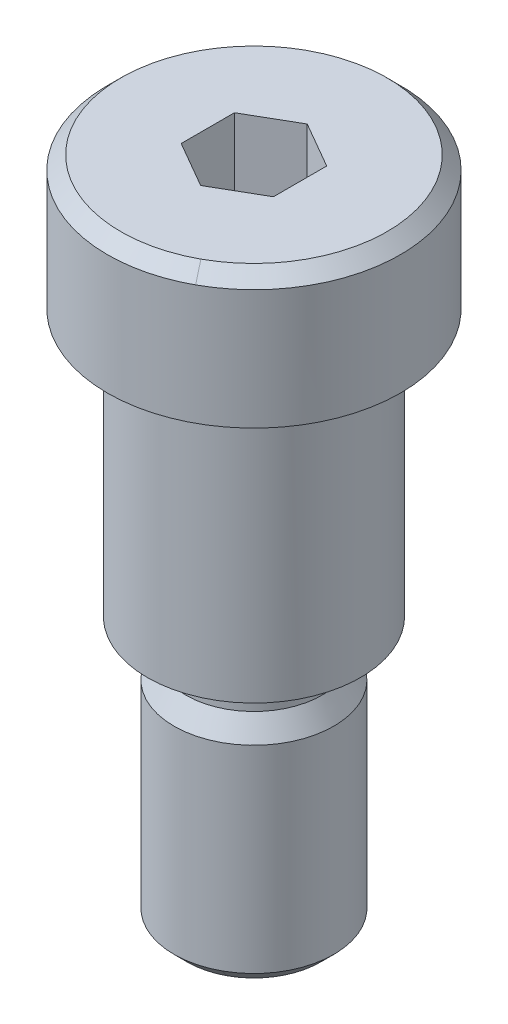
ISO-10303-21;
HEADER;
FILE_DESCRIPTION(('STEP AP214'),'2;1');
FILE_NAME('part.step','',(''),(''),'','','');
FILE_SCHEMA(('AUTOMOTIVE_DESIGN { 1 0 10303 214 1 1 1 1 }'));
ENDSEC;
DATA;
#1=APPLICATION_CONTEXT('core data for automotive mechanical design processes');
#2=APPLICATION_PROTOCOL_DEFINITION('international standard','automotive_design',2000,#1);
#3=PRODUCT_CONTEXT('',#1,'mechanical');
#4=PRODUCT('Part','Part','',(#3));
#5=PRODUCT_RELATED_PRODUCT_CATEGORY('part','',(#4));
#6=PRODUCT_DEFINITION_FORMATION('','',#4);
#7=PRODUCT_DEFINITION_CONTEXT('part definition',#1,'design');
#8=PRODUCT_DEFINITION('design','',#6,#7);
#9=PRODUCT_DEFINITION_SHAPE('','',#8);
#10=(LENGTH_UNIT() NAMED_UNIT(*) SI_UNIT(.MILLI.,.METRE.));
#11=(NAMED_UNIT(*) PLANE_ANGLE_UNIT() SI_UNIT($,.RADIAN.));
#12=(NAMED_UNIT(*) SI_UNIT($,.STERADIAN.) SOLID_ANGLE_UNIT());
#13=UNCERTAINTY_MEASURE_WITH_UNIT(LENGTH_MEASURE(1.E-05),#10,'distance_accuracy_value','');
#14=(GEOMETRIC_REPRESENTATION_CONTEXT(3) GLOBAL_UNCERTAINTY_ASSIGNED_CONTEXT((#13)) GLOBAL_UNIT_ASSIGNED_CONTEXT((#10,
#11,#12)) REPRESENTATION_CONTEXT('',''));
#15=CARTESIAN_POINT('',(0.,0.,0.));
#16=DIRECTION('',(0.,0.,1.));
#17=DIRECTION('',(1.,0.,0.));
#18=AXIS2_PLACEMENT_3D('',#15,#16,#17);
#19=CARTESIAN_POINT('',(0.,-50.,6.00000000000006));
#20=DIRECTION('',(0.,1.,0.));
#21=DIRECTION('',(0.,0.,1.));
#22=AXIS2_PLACEMENT_3D('',#19,#20,#21);
#23=PLANE('',#22);
#24=CARTESIAN_POINT('',(0.,-49.9999999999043,0.));
#25=DIRECTION('',(0.,1.,0.));
#26=DIRECTION('',(0.,0.,1.));
#27=AXIS2_PLACEMENT_3D('',#24,#25,#26);
#28=CIRCLE('',#27,4.9999999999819);
#29=CARTESIAN_POINT('',(-2.39712768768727,-49.9999999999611,-4.38791281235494));
#30=VERTEX_POINT('',#29);
#31=CARTESIAN_POINT('',(2.39712769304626,-49.9999999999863,4.38791280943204));
#32=VERTEX_POINT('',#31);
#33=EDGE_CURVE('E239',#30,#32,#28,.T.);
#34=ORIENTED_EDGE('',*,*,#33,.F.);
#35=CARTESIAN_POINT('',(0.,-50.000000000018,0.));
#36=DIRECTION('',(0.,1.,0.));
#37=DIRECTION('',(0.,0.,1.));
#38=AXIS2_PLACEMENT_3D('',#35,#36,#37);
#39=CIRCLE('',#38,4.99999999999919);
#40=EDGE_CURVE('E89',#32,#30,#39,.T.);
#41=ORIENTED_EDGE('',*,*,#40,.F.);
#42=EDGE_LOOP('',(#34,#41));
#43=FACE_BOUND('',#42,.T.);
#44=ADVANCED_FACE('F30',(#43),#23,.F.);
#45=CARTESIAN_POINT('',(0.,-49.000000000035,0.));
#46=DIRECTION('',(0.,1.,0.));
#47=DIRECTION('',(0.,0.,1.));
#48=AXIS2_PLACEMENT_3D('',#45,#46,#47);
#49=CONICAL_SURFACE('',#48,5.99999999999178,0.78539816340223);
#50=CARTESIAN_POINT('',(-2.87655323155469,-48.9999999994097,-5.26549537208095));
#51=CARTESIAN_POINT('',(-2.85657716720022,-49.0416666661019,-5.22892943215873));
#52=CARTESIAN_POINT('',(-2.83660110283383,-49.0833333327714,-5.19236349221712));
#53=CARTESIAN_POINT('',(-2.79664897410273,-49.1666666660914,-5.11923161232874));
#54=CARTESIAN_POINT('',(-2.77667290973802,-49.2083333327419,-5.08266567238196));
#55=CARTESIAN_POINT('',(-2.73672078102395,-49.2916666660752,-5.00953379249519));
#56=CARTESIAN_POINT('',(-2.7167447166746,-49.333333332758,-4.9729678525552));
#57=CARTESIAN_POINT('',(-2.67679258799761,-49.4166666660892,-4.89983597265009));
#58=CARTESIAN_POINT('',(-2.65681652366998,-49.4583333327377,-4.86327003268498));
#59=CARTESIAN_POINT('',(-2.61686439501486,-49.5416666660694,-4.79013815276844));
#60=CARTESIAN_POINT('',(-2.59688833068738,-49.5833333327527,-4.75357221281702));
#61=CARTESIAN_POINT('',(-2.55693620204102,-49.6666666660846,-4.6804403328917));
#62=CARTESIAN_POINT('',(-2.53696013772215,-49.7083333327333,-4.64387439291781));
#63=CARTESIAN_POINT('',(-2.49700800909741,-49.7916666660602,-4.57074251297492));
#64=CARTESIAN_POINT('',(-2.47703194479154,-49.8333333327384,-4.53417657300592));
#65=CARTESIAN_POINT('',(-2.43707981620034,-49.9166666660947,-4.46104469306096));
#66=CARTESIAN_POINT('',(-2.41710375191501,-49.9583333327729,-4.424478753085));
#67=CARTESIAN_POINT('',(-2.39712768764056,-49.9999999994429,-4.38791281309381));
#68=B_SPLINE_CURVE_WITH_KNOTS('',3,(#50,#51,#52,#53,#54,#55,#56,#57,#58,#59,#60,#61,#62,#63,#64,
#65,#66,#67),.UNSPECIFIED.,.F.,.F.,(4,2,2,2,2,2,2,2,4),(0.,0.176776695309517,0.353553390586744,
0.530330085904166,0.707106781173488,0.88388347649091,1.06066017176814,1.23743686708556,
1.41421356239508),.UNSPECIFIED.);
#69=CARTESIAN_POINT('',(-2.87655323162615,-48.9999999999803,-5.26549537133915));
#70=VERTEX_POINT('',#69);
#71=EDGE_CURVE('E228',#70,#30,#68,.T.);
#72=ORIENTED_EDGE('',*,*,#71,.F.);
#73=CARTESIAN_POINT('',(0.,-49.,0.));
#74=DIRECTION('',(0.,1.,0.));
#75=DIRECTION('',(0.,0.,1.));
#76=AXIS2_PLACEMENT_3D('',#73,#74,#75);
#77=CIRCLE('',#76,6.);
#78=CARTESIAN_POINT('',(2.87655323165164,-48.9999999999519,5.26549537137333));
#79=VERTEX_POINT('',#78);
#80=EDGE_CURVE('E238',#79,#70,#77,.T.);
#81=ORIENTED_EDGE('',*,*,#80,.F.);
#82=DIRECTION('',(-0.339005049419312,-0.707106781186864,-0.620544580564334));
#83=VECTOR('',#82,1.);
#84=CARTESIAN_POINT('',(239259.712166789,498999.999999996,437961.965424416));
#85=LINE('',#84,#83);
#86=EDGE_CURVE('E230',#32,#79,#85,.F.);
#87=ORIENTED_EDGE('',*,*,#86,.F.);
#88=ORIENTED_EDGE('',*,*,#40,.T.);
#89=EDGE_LOOP('',(#72,#81,#87,#88));
#90=FACE_BOUND('',#89,.T.);
#91=ADVANCED_FACE('F219',(#90),#49,.T.);
#92=CARTESIAN_POINT('',(0.,-48.9999999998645,0.));
#93=DIRECTION('',(0.,1.,0.));
#94=DIRECTION('',(0.,0.,1.));
#95=AXIS2_PLACEMENT_3D('',#92,#93,#94);
#96=CONICAL_SURFACE('',#95,6.00000000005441,0.785398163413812);
#97=ORIENTED_EDGE('',*,*,#86,.T.);
#98=CARTESIAN_POINT('',(0.,-49.,0.));
#99=DIRECTION('',(0.,1.,0.));
#100=DIRECTION('',(0.,0.,1.));
#101=AXIS2_PLACEMENT_3D('',#98,#99,#100);
#102=CIRCLE('',#101,6.);
#103=EDGE_CURVE('E248',#70,#79,#102,.T.);
#104=ORIENTED_EDGE('',*,*,#103,.F.);
#105=ORIENTED_EDGE('',*,*,#71,.T.);
#106=ORIENTED_EDGE('',*,*,#33,.T.);
#107=EDGE_LOOP('',(#97,#104,#105,#106));
#108=FACE_BOUND('',#107,.T.);
#109=ADVANCED_FACE('F221',(#108),#96,.T.);
#110=CARTESIAN_POINT('',(0.,0.,0.));
#111=DIRECTION('',(0.,1.,0.));
#112=DIRECTION('',(0.,0.,1.));
#113=AXIS2_PLACEMENT_3D('',#110,#111,#112);
#114=PLANE('',#113);
#115=DIRECTION('',(-0.86602540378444,0.,0.500000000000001));
#116=VECTOR('',#115,1.);
#117=CARTESIAN_POINT('',(0.,1.11022302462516E-13,-4.));
#118=LINE('',#117,#116);
#119=CARTESIAN_POINT('',(0.,1.11022302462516E-13,-4.));
#120=VERTEX_POINT('',#119);
#121=CARTESIAN_POINT('',(-3.46410161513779,0.,-2.00000000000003));
#122=VERTEX_POINT('',#121);
#123=EDGE_CURVE('E49',#120,#122,#118,.T.);
#124=ORIENTED_EDGE('',*,*,#123,.F.);
#125=DIRECTION('',(-0.86602540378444,0.,-0.500000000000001));
#126=VECTOR('',#125,1.);
#127=CARTESIAN_POINT('',(3.46410161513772,0.,-2.00000000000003));
#128=LINE('',#127,#126);
#129=CARTESIAN_POINT('',(3.46410161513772,0.,-2.00000000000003));
#130=VERTEX_POINT('',#129);
#131=EDGE_CURVE('E294',#130,#120,#128,.T.);
#132=ORIENTED_EDGE('',*,*,#131,.F.);
#133=DIRECTION('',(0.,0.,-1.));
#134=VECTOR('',#133,1.);
#135=CARTESIAN_POINT('',(3.46410161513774,0.,1.99999999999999));
#136=LINE('',#135,#134);
#137=CARTESIAN_POINT('',(3.46410161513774,0.,1.99999999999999));
#138=VERTEX_POINT('',#137);
#139=EDGE_CURVE('E296',#138,#130,#136,.T.);
#140=ORIENTED_EDGE('',*,*,#139,.F.);
#141=DIRECTION('',(0.866025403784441,0.,-0.500000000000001));
#142=VECTOR('',#141,1.);
#143=CARTESIAN_POINT('',(0.,0.,4.));
#144=LINE('',#143,#142);
#145=CARTESIAN_POINT('',(0.,0.,4.));
#146=VERTEX_POINT('',#145);
#147=EDGE_CURVE('E299',#146,#138,#144,.T.);
#148=ORIENTED_EDGE('',*,*,#147,.F.);
#149=DIRECTION('',(0.86602540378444,0.,0.500000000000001));
#150=VECTOR('',#149,1.);
#151=CARTESIAN_POINT('',(-3.46410161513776,0.,2.00000000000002));
#152=LINE('',#151,#150);
#153=CARTESIAN_POINT('',(-3.46410161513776,0.,2.00000000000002));
#154=VERTEX_POINT('',#153);
#155=EDGE_CURVE('E302',#154,#146,#152,.T.);
#156=ORIENTED_EDGE('',*,*,#155,.F.);
#157=DIRECTION('',(0.,0.,1.));
#158=VECTOR('',#157,1.);
#159=CARTESIAN_POINT('',(-3.46410161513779,0.,-2.00000000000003));
#160=LINE('',#159,#158);
#161=EDGE_CURVE('E304',#122,#154,#160,.T.);
#162=ORIENTED_EDGE('',*,*,#161,.F.);
#163=EDGE_LOOP('',(#124,#132,#140,#148,#156,#162));
#164=FACE_BOUND('',#163,.T.);
#165=CARTESIAN_POINT('',(0.,5.69683189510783E-11,0.));
#166=DIRECTION('',(0.,-1.,0.));
#167=DIRECTION('',(0.,0.,-1.));
#168=AXIS2_PLACEMENT_3D('',#165,#166,#167);
#169=CIRCLE('',#168,10.0000000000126);
#170=CARTESIAN_POINT('',(-4.79425475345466,2.59653409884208E-11,-8.77582596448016));
#171=VERTEX_POINT('',#170);
#172=CARTESIAN_POINT('',(4.79425538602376,5.43870504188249E-11,8.77582561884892));
#173=VERTEX_POINT('',#172);
#174=EDGE_CURVE('E189',#171,#173,#169,.T.);
#175=ORIENTED_EDGE('',*,*,#174,.F.);
#176=CARTESIAN_POINT('',(0.,-5.02375918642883E-12,0.));
#177=DIRECTION('',(0.,-1.,0.));
#178=DIRECTION('',(0.,0.,-1.));
#179=AXIS2_PLACEMENT_3D('',#176,#177,#178);
#180=CIRCLE('',#179,9.99999999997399);
#181=EDGE_CURVE('E246',#173,#171,#180,.T.);
#182=ORIENTED_EDGE('',*,*,#181,.F.);
#183=EDGE_LOOP('',(#175,#182));
#184=FACE_BOUND('',#183,.T.);
#185=ADVANCED_FACE('F313',(#164,#184),#114,.T.);
#186=CARTESIAN_POINT('',(0.,-24.9999999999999,0.));
#187=DIRECTION('',(0.,1.,0.));
#188=DIRECTION('',(0.,0.,1.));
#189=AXIS2_PLACEMENT_3D('',#186,#187,#188);
#190=CYLINDRICAL_SURFACE('',#189,6.);
#191=CARTESIAN_POINT('',(0.,-34.1588457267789,0.));
#192=DIRECTION('',(0.,-1.,0.));
#193=DIRECTION('',(0.47942553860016,0.,0.877582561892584));
#194=AXIS2_PLACEMENT_3D('',#191,#192,#193);
#195=CIRCLE('',#194,5.99999999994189);
#196=CARTESIAN_POINT('',(2.87655323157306,-34.1588457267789,5.26549537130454));
#197=VERTEX_POINT('',#196);
#198=EDGE_CURVE('E179',#197,#197,#195,.F.);
#199=ORIENTED_EDGE('',*,*,#198,.F.);
#200=EDGE_LOOP('',(#199));
#201=FACE_BOUND('',#200,.T.);
#202=ORIENTED_EDGE('',*,*,#103,.T.);
#203=ORIENTED_EDGE('',*,*,#80,.T.);
#204=EDGE_LOOP('',(#202,#203));
#205=FACE_BOUND('',#204,.T.);
#206=ADVANCED_FACE('F358',(#201,#205),#190,.T.);
#207=CARTESIAN_POINT('',(0.,-0.999999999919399,0.));
#208=DIRECTION('',(0.,-1.,0.));
#209=DIRECTION('',(0.,0.,-1.));
#210=AXIS2_PLACEMENT_3D('',#207,#208,#209);
#211=CONICAL_SURFACE('',#210,10.9999999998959,0.78539816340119);
#212=DIRECTION('',(-0.339005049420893,0.707106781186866,-0.620544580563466));
#213=VECTOR('',#212,1.);
#214=CARTESIAN_POINT('',(239238.138018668,-499000.,437922.47420852));
#215=LINE('',#214,#213);
#216=CARTESIAN_POINT('',(5.27368092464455,-0.999999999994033,9.65340818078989));
#217=VERTEX_POINT('',#216);
#218=EDGE_CURVE('E190',#173,#217,#215,.F.);
#219=ORIENTED_EDGE('',*,*,#218,.F.);
#220=ORIENTED_EDGE('',*,*,#181,.T.);
#221=CARTESIAN_POINT('',(-5.27368092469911,-1.00000000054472,-9.6534081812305));
#222=CARTESIAN_POINT('',(-5.25370483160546,-0.958333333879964,-9.61684225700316));
#223=CARTESIAN_POINT('',(-5.23372873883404,-0.916666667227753,-9.58027633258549));
#224=CARTESIAN_POINT('',(-5.19377655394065,-0.833333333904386,-9.50714448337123));
#225=CARTESIAN_POINT('',(-5.1738004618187,-0.791666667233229,-9.47057855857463));
#226=CARTESIAN_POINT('',(-5.13384827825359,-0.708333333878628,-9.39744670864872));
#227=CARTESIAN_POINT('',(-5.11387218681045,-0.666666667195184,-9.36088078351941));
#228=CARTESIAN_POINT('',(-5.07392000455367,-0.583333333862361,-9.28774893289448));
#229=CARTESIAN_POINT('',(-5.05394391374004,-0.541666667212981,-9.25118300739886));
#230=CARTESIAN_POINT('',(-5.01399173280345,-0.458333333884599,-9.1780511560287));
#231=CARTESIAN_POINT('',(-4.99401564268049,-0.416666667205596,-9.14148523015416));
#232=CARTESIAN_POINT('',(-4.95406346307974,-0.333333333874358,-9.06835337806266));
#233=CARTESIAN_POINT('',(-4.93408737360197,-0.291666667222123,-9.03178745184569));
#234=CARTESIAN_POINT('',(-4.89413519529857,-0.208333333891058,-8.95865559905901));
#235=CARTESIAN_POINT('',(-4.87415910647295,-0.166666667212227,-8.9220896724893));
#236=CARTESIAN_POINT('',(-4.83420692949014,-0.083333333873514,-8.8489578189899));
#237=CARTESIAN_POINT('',(-4.81423084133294,-0.0416666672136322,-8.81239189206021));
#238=CARTESIAN_POINT('',(-4.79425475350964,-5.68378677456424E-10,-8.77582596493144));
#239=B_SPLINE_CURVE_WITH_KNOTS('',3,(#221,#222,#223,#224,#225,#226,#227,#228,#229,#230,#231,
#232,#233,#234,#235,#236,#237,#238),.UNSPECIFIED.,.F.,.F.,(4,2,2,2,2,2,2,2,4),(0.,
0.176776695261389,0.35355339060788,0.530330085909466,0.70710678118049,0.883883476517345,
1.06066017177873,1.23743686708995,1.41421356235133),.UNSPECIFIED.);
#240=CARTESIAN_POINT('',(-5.27368092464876,-0.999999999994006,-9.65340818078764));
#241=VERTEX_POINT('',#240);
#242=EDGE_CURVE('E186',#241,#171,#239,.T.);
#243=ORIENTED_EDGE('',*,*,#242,.F.);
#244=CARTESIAN_POINT('',(0.,-0.999999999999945,0.));
#245=DIRECTION('',(0.,1.,0.));
#246=DIRECTION('',(0.,0.,1.));
#247=AXIS2_PLACEMENT_3D('',#244,#245,#246);
#248=CIRCLE('',#247,11.);
#249=EDGE_CURVE('E176',#217,#241,#248,.F.);
#250=ORIENTED_EDGE('',*,*,#249,.F.);
#251=EDGE_LOOP('',(#219,#220,#243,#250));
#252=FACE_BOUND('',#251,.T.);
#253=ADVANCED_FACE('F205',(#252),#211,.T.);
#254=CARTESIAN_POINT('',(0.,-0.999999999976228,0.));
#255=DIRECTION('',(0.,-1.,0.));
#256=DIRECTION('',(0.,0.,-1.));
#257=AXIS2_PLACEMENT_3D('',#254,#255,#256);
#258=CONICAL_SURFACE('',#257,10.999999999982,0.785398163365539);
#259=ORIENTED_EDGE('',*,*,#242,.T.);
#260=ORIENTED_EDGE('',*,*,#174,.T.);
#261=ORIENTED_EDGE('',*,*,#218,.T.);
#262=CARTESIAN_POINT('',(0.,-0.999999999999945,0.));
#263=DIRECTION('',(0.,1.,0.));
#264=DIRECTION('',(0.,0.,1.));
#265=AXIS2_PLACEMENT_3D('',#262,#263,#264);
#266=CIRCLE('',#265,11.);
#267=EDGE_CURVE('E175',#241,#217,#266,.F.);
#268=ORIENTED_EDGE('',*,*,#267,.F.);
#269=EDGE_LOOP('',(#259,#260,#261,#268));
#270=FACE_BOUND('',#269,.T.);
#271=ADVANCED_FACE('F207',(#270),#258,.T.);
#272=CARTESIAN_POINT('',(0.,-34.1588457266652,0.));
#273=DIRECTION('',(0.,-1.,0.));
#274=DIRECTION('',(0.,0.,-1.));
#275=AXIS2_PLACEMENT_3D('',#272,#273,#274);
#276=CONICAL_SURFACE('',#275,5.99999999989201,0.523598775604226);
#277=ORIENTED_EDGE('',*,*,#198,.T.);
#278=EDGE_LOOP('',(#277));
#279=FACE_BOUND('',#278,.T.);
#280=CARTESIAN_POINT('',(0.,-32.6,0.));
#281=DIRECTION('',(0.,1.,0.));
#282=DIRECTION('',(0.,0.,1.));
#283=AXIS2_PLACEMENT_3D('',#280,#281,#282);
#284=CIRCLE('',#283,5.1);
#285=CARTESIAN_POINT('',(0.,-32.6,5.10000000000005));
#286=VERTEX_POINT('',#285);
#287=EDGE_CURVE('E172',#286,#286,#284,.T.);
#288=ORIENTED_EDGE('',*,*,#287,.F.);
#289=EDGE_LOOP('',(#288));
#290=FACE_BOUND('',#289,.T.);
#291=ADVANCED_FACE('F369',(#279,#290),#276,.T.);
#292=CARTESIAN_POINT('',(0.,-24.9999999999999,0.));
#293=DIRECTION('',(0.,1.,0.));
#294=DIRECTION('',(0.,0.,1.));
#295=AXIS2_PLACEMENT_3D('',#292,#293,#294);
#296=CYLINDRICAL_SURFACE('',#295,11.);
#297=CARTESIAN_POINT('',(0.,-9.99999999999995,0.));
#298=DIRECTION('',(0.,1.,0.));
#299=DIRECTION('',(0.,0.,1.));
#300=AXIS2_PLACEMENT_3D('',#297,#298,#299);
#301=CIRCLE('',#300,11.);
#302=CARTESIAN_POINT('',(0.,-9.99999999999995,11.0000000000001));
#303=VERTEX_POINT('',#302);
#304=EDGE_CURVE('E171',#303,#303,#301,.T.);
#305=ORIENTED_EDGE('',*,*,#304,.T.);
#306=EDGE_LOOP('',(#305));
#307=FACE_BOUND('',#306,.T.);
#308=ORIENTED_EDGE('',*,*,#267,.T.);
#309=ORIENTED_EDGE('',*,*,#249,.T.);
#310=EDGE_LOOP('',(#308,#309));
#311=FACE_BOUND('',#310,.T.);
#312=ADVANCED_FACE('F433',(#307,#311),#296,.T.);
#313=CARTESIAN_POINT('',(0.,-24.9999999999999,0.));
#314=DIRECTION('',(0.,1.,0.));
#315=DIRECTION('',(0.,0.,1.));
#316=AXIS2_PLACEMENT_3D('',#313,#314,#315);
#317=CYLINDRICAL_SURFACE('',#316,5.1);
#318=ORIENTED_EDGE('',*,*,#287,.T.);
#319=EDGE_LOOP('',(#318));
#320=FACE_BOUND('',#319,.T.);
#321=CARTESIAN_POINT('',(0.,-30.9,0.));
#322=DIRECTION('',(0.,1.,0.));
#323=DIRECTION('',(0.479425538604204,0.,0.877582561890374));
#324=AXIS2_PLACEMENT_3D('',#321,#322,#323);
#325=CIRCLE('',#324,5.1);
#326=CARTESIAN_POINT('',(2.44507024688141,-30.9,4.47567106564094));
#327=VERTEX_POINT('',#326);
#328=EDGE_CURVE('E116',#327,#327,#325,.F.);
#329=ORIENTED_EDGE('',*,*,#328,.T.);
#330=EDGE_LOOP('',(#329));
#331=FACE_BOUND('',#330,.T.);
#332=ADVANCED_FACE('F141',(#320,#331),#317,.T.);
#333=CARTESIAN_POINT('',(0.,-9.99999999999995,11.));
#334=DIRECTION('',(0.,1.,0.));
#335=DIRECTION('',(0.,0.,1.));
#336=AXIS2_PLACEMENT_3D('',#333,#334,#335);
#337=PLANE('',#336);
#338=CARTESIAN_POINT('',(0.,-9.99999999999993,0.));
#339=DIRECTION('',(0.,-1.,0.));
#340=DIRECTION('',(-0.479425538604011,0.,-0.877582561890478));
#341=AXIS2_PLACEMENT_3D('',#338,#339,#340);
#342=CIRCLE('',#341,7.99999999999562);
#343=CARTESIAN_POINT('',(3.83540430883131,-9.99999999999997,7.02066049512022));
#344=VERTEX_POINT('',#343);
#345=CARTESIAN_POINT('',(-3.83540430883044,-9.99999999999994,-7.02066049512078));
#346=VERTEX_POINT('',#345);
#347=EDGE_CURVE('E108',#344,#346,#342,.F.);
#348=ORIENTED_EDGE('',*,*,#347,.T.);
#349=CARTESIAN_POINT('',(0.,-9.99999999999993,0.));
#350=DIRECTION('',(0.,-1.,0.));
#351=DIRECTION('',(0.479425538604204,0.,0.877582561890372));
#352=AXIS2_PLACEMENT_3D('',#349,#350,#351);
#353=CIRCLE('',#352,7.9999999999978);
#354=EDGE_CURVE('E112',#346,#344,#353,.F.);
#355=ORIENTED_EDGE('',*,*,#354,.T.);
#356=EDGE_LOOP('',(#348,#355));
#357=FACE_BOUND('',#356,.T.);
#358=ORIENTED_EDGE('',*,*,#304,.F.);
#359=EDGE_LOOP('',(#358));
#360=FACE_BOUND('',#359,.T.);
#361=ADVANCED_FACE('F120',(#357,#360),#337,.F.);
#362=CARTESIAN_POINT('',(0.,-30.8999999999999,0.));
#363=DIRECTION('',(0.,1.,0.));
#364=DIRECTION('',(0.479425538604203,0.,0.877582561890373));
#365=AXIS2_PLACEMENT_3D('',#362,#363,#364);
#366=TOROIDAL_SURFACE('',#365,5.99999999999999,0.9);
#367=ORIENTED_EDGE('',*,*,#328,.F.);
#368=EDGE_LOOP('',(#367));
#369=FACE_BOUND('',#368,.T.);
#370=CARTESIAN_POINT('',(0.,-29.9999999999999,0.));
#371=DIRECTION('',(0.,-1.,0.));
#372=DIRECTION('',(0.479425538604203,0.,0.877582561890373));
#373=AXIS2_PLACEMENT_3D('',#370,#371,#372);
#374=CIRCLE('',#373,6.00000000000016);
#375=CARTESIAN_POINT('',(2.87655323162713,-29.9999999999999,5.26549537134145));
#376=VERTEX_POINT('',#375);
#377=CARTESIAN_POINT('',(-2.87655323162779,-29.9999999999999,-5.26549537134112));
#378=VERTEX_POINT('',#377);
#379=EDGE_CURVE('E485',#376,#378,#374,.T.);
#380=ORIENTED_EDGE('',*,*,#379,.T.);
#381=CARTESIAN_POINT('',(0.,-29.9999999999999,0.));
#382=DIRECTION('',(0.,-1.,0.));
#383=DIRECTION('',(-0.479425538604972,0.,-0.877582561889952));
#384=AXIS2_PLACEMENT_3D('',#381,#382,#383);
#385=CIRCLE('',#384,6.00000000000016);
#386=EDGE_CURVE('E57',#378,#376,#385,.T.);
#387=ORIENTED_EDGE('',*,*,#386,.T.);
#388=EDGE_LOOP('',(#380,#387));
#389=FACE_BOUND('',#388,.T.);
#390=ADVANCED_FACE('F140',(#369,#389),#366,.F.);
#391=CARTESIAN_POINT('',(0.,-10.8999999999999,0.));
#392=DIRECTION('',(0.,1.,0.));
#393=DIRECTION('',(0.479425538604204,0.,0.877582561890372));
#394=AXIS2_PLACEMENT_3D('',#391,#392,#393);
#395=TOROIDAL_SURFACE('',#394,7.99999999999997,0.9);
#396=CARTESIAN_POINT('',(0.,-11.7999999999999,0.));
#397=DIRECTION('',(0.,1.,0.));
#398=DIRECTION('',(0.,0.,1.));
#399=AXIS2_PLACEMENT_3D('',#396,#397,#398);
#400=CIRCLE('',#399,8.);
#401=CARTESIAN_POINT('',(0.,-11.7999999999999,8.00000000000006));
#402=VERTEX_POINT('',#401);
#403=EDGE_CURVE('E41',#402,#402,#400,.F.);
#404=ORIENTED_EDGE('',*,*,#403,.F.);
#405=EDGE_LOOP('',(#404));
#406=FACE_BOUND('',#405,.T.);
#407=ORIENTED_EDGE('',*,*,#354,.F.);
#408=ORIENTED_EDGE('',*,*,#347,.F.);
#409=EDGE_LOOP('',(#407,#408));
#410=FACE_BOUND('',#409,.T.);
#411=ADVANCED_FACE('F111',(#406,#410),#395,.F.);
#412=CARTESIAN_POINT('',(0.,-30.,8.00000000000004));
#413=DIRECTION('',(0.,1.,0.));
#414=DIRECTION('',(0.,0.,1.));
#415=AXIS2_PLACEMENT_3D('',#412,#413,#414);
#416=PLANE('',#415);
#417=ORIENTED_EDGE('',*,*,#386,.F.);
#418=ORIENTED_EDGE('',*,*,#379,.F.);
#419=EDGE_LOOP('',(#417,#418));
#420=FACE_BOUND('',#419,.T.);
#421=CARTESIAN_POINT('',(0.,-29.9999999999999,0.));
#422=DIRECTION('',(0.,1.,0.));
#423=DIRECTION('',(0.,0.,1.));
#424=AXIS2_PLACEMENT_3D('',#421,#422,#423);
#425=CIRCLE('',#424,8.);
#426=CARTESIAN_POINT('',(0.,-29.9999999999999,8.00000000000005));
#427=VERTEX_POINT('',#426);
#428=EDGE_CURVE('E11',#427,#427,#425,.T.);
#429=ORIENTED_EDGE('',*,*,#428,.F.);
#430=EDGE_LOOP('',(#429));
#431=FACE_BOUND('',#430,.T.);
#432=ADVANCED_FACE('F345',(#420,#431),#416,.F.);
#433=CARTESIAN_POINT('',(0.,-24.9999999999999,0.));
#434=DIRECTION('',(0.,1.,0.));
#435=DIRECTION('',(0.,0.,1.));
#436=AXIS2_PLACEMENT_3D('',#433,#434,#435);
#437=CYLINDRICAL_SURFACE('',#436,8.);
#438=ORIENTED_EDGE('',*,*,#428,.T.);
#439=EDGE_LOOP('',(#438));
#440=FACE_BOUND('',#439,.T.);
#441=ORIENTED_EDGE('',*,*,#403,.T.);
#442=EDGE_LOOP('',(#441));
#443=FACE_BOUND('',#442,.T.);
#444=ADVANCED_FACE('F32',(#440,#443),#437,.T.);
#445=CARTESIAN_POINT('',(0.,-5.99999999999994,-4.));
#446=DIRECTION('',(-0.500000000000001,0.,-0.86602540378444));
#447=DIRECTION('',(-0.866025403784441,0.,0.500000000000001));
#448=AXIS2_PLACEMENT_3D('',#445,#446,#447);
#449=PLANE('',#448);
#450=ORIENTED_EDGE('',*,*,#123,.T.);
#451=DIRECTION('',(0.,1.,0.));
#452=VECTOR('',#451,1.);
#453=CARTESIAN_POINT('',(-3.46410161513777,-5.99999999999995,-2.00000000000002));
#454=LINE('',#453,#452);
#455=CARTESIAN_POINT('',(-3.46410161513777,-5.99999999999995,-2.00000000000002));
#456=VERTEX_POINT('',#455);
#457=EDGE_CURVE('E213',#456,#122,#454,.T.);
#458=ORIENTED_EDGE('',*,*,#457,.F.);
#459=DIRECTION('',(-0.86602540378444,0.,0.500000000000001));
#460=VECTOR('',#459,1.);
#461=CARTESIAN_POINT('',(0.,-5.99999999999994,-4.));
#462=LINE('',#461,#460);
#463=CARTESIAN_POINT('',(0.,-5.99999999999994,-4.));
#464=VERTEX_POINT('',#463);
#465=EDGE_CURVE('E292',#464,#456,#462,.T.);
#466=ORIENTED_EDGE('',*,*,#465,.F.);
#467=DIRECTION('',(0.,1.,0.));
#468=VECTOR('',#467,1.);
#469=CARTESIAN_POINT('',(0.,-5.99999999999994,-4.));
#470=LINE('',#469,#468);
#471=EDGE_CURVE('E97',#464,#120,#470,.T.);
#472=ORIENTED_EDGE('',*,*,#471,.T.);
#473=EDGE_LOOP('',(#450,#458,#466,#472));
#474=FACE_BOUND('',#473,.T.);
#475=ADVANCED_FACE('F336',(#474),#449,.F.);
#476=CARTESIAN_POINT('',(3.46410161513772,-5.99999999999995,-2.00000000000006));
#477=DIRECTION('',(0.500000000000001,0.,-0.86602540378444));
#478=DIRECTION('',(-0.86602540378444,0.,-0.500000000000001));
#479=AXIS2_PLACEMENT_3D('',#476,#477,#478);
#480=PLANE('',#479);
#481=ORIENTED_EDGE('',*,*,#131,.T.);
#482=ORIENTED_EDGE('',*,*,#471,.F.);
#483=DIRECTION('',(-0.86602540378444,0.,-0.500000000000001));
#484=VECTOR('',#483,1.);
#485=CARTESIAN_POINT('',(3.46410161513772,-5.99999999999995,-2.00000000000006));
#486=LINE('',#485,#484);
#487=CARTESIAN_POINT('',(3.46410161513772,-5.99999999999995,-2.00000000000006));
#488=VERTEX_POINT('',#487);
#489=EDGE_CURVE('E258',#488,#464,#486,.T.);
#490=ORIENTED_EDGE('',*,*,#489,.F.);
#491=DIRECTION('',(0.,1.,0.));
#492=VECTOR('',#491,1.);
#493=CARTESIAN_POINT('',(3.46410161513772,-5.99999999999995,-2.00000000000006));
#494=LINE('',#493,#492);
#495=EDGE_CURVE('E251',#488,#130,#494,.T.);
#496=ORIENTED_EDGE('',*,*,#495,.T.);
#497=EDGE_LOOP('',(#481,#482,#490,#496));
#498=FACE_BOUND('',#497,.T.);
#499=ADVANCED_FACE('F338',(#498),#480,.F.);
#500=CARTESIAN_POINT('',(3.46410161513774,-5.99999999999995,2.));
#501=DIRECTION('',(1.,0.,0.));
#502=DIRECTION('',(0.,0.,-1.));
#503=AXIS2_PLACEMENT_3D('',#500,#501,#502);
#504=PLANE('',#503);
#505=ORIENTED_EDGE('',*,*,#139,.T.);
#506=ORIENTED_EDGE('',*,*,#495,.F.);
#507=DIRECTION('',(0.,0.,-1.));
#508=VECTOR('',#507,1.);
#509=CARTESIAN_POINT('',(3.46410161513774,-5.99999999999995,2.));
#510=LINE('',#509,#508);
#511=CARTESIAN_POINT('',(3.46410161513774,-5.99999999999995,2.));
#512=VERTEX_POINT('',#511);
#513=EDGE_CURVE('E277',#512,#488,#510,.T.);
#514=ORIENTED_EDGE('',*,*,#513,.F.);
#515=DIRECTION('',(0.,1.,0.));
#516=VECTOR('',#515,1.);
#517=CARTESIAN_POINT('',(3.46410161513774,-5.99999999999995,2.));
#518=LINE('',#517,#516);
#519=EDGE_CURVE('E255',#512,#138,#518,.T.);
#520=ORIENTED_EDGE('',*,*,#519,.T.);
#521=EDGE_LOOP('',(#505,#506,#514,#520));
#522=FACE_BOUND('',#521,.T.);
#523=ADVANCED_FACE('F334',(#522),#504,.F.);
#524=CARTESIAN_POINT('',(0.,-5.99999999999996,4.));
#525=DIRECTION('',(0.500000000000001,0.,0.866025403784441));
#526=DIRECTION('',(0.866025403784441,0.,-0.500000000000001));
#527=AXIS2_PLACEMENT_3D('',#524,#525,#526);
#528=PLANE('',#527);
#529=ORIENTED_EDGE('',*,*,#147,.T.);
#530=ORIENTED_EDGE('',*,*,#519,.F.);
#531=DIRECTION('',(0.866025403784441,0.,-0.500000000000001));
#532=VECTOR('',#531,1.);
#533=CARTESIAN_POINT('',(0.,-5.99999999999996,4.));
#534=LINE('',#533,#532);
#535=CARTESIAN_POINT('',(0.,-5.99999999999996,4.));
#536=VERTEX_POINT('',#535);
#537=EDGE_CURVE('E281',#536,#512,#534,.T.);
#538=ORIENTED_EDGE('',*,*,#537,.F.);
#539=DIRECTION('',(0.,1.,0.));
#540=VECTOR('',#539,1.);
#541=CARTESIAN_POINT('',(0.,-5.99999999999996,4.));
#542=LINE('',#541,#540);
#543=EDGE_CURVE('E263',#536,#146,#542,.T.);
#544=ORIENTED_EDGE('',*,*,#543,.T.);
#545=EDGE_LOOP('',(#529,#530,#538,#544));
#546=FACE_BOUND('',#545,.T.);
#547=ADVANCED_FACE('F332',(#546),#528,.F.);
#548=CARTESIAN_POINT('',(-3.46410161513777,-5.99999999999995,1.99999999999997));
#549=DIRECTION('',(-0.500000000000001,0.,0.86602540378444));
#550=DIRECTION('',(0.86602540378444,0.,0.500000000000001));
#551=AXIS2_PLACEMENT_3D('',#548,#549,#550);
#552=PLANE('',#551);
#553=ORIENTED_EDGE('',*,*,#155,.T.);
#554=ORIENTED_EDGE('',*,*,#543,.F.);
#555=DIRECTION('',(0.86602540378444,0.,0.500000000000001));
#556=VECTOR('',#555,1.);
#557=CARTESIAN_POINT('',(-3.46410161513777,-5.99999999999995,1.99999999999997));
#558=LINE('',#557,#556);
#559=CARTESIAN_POINT('',(-3.46410161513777,-5.99999999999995,1.99999999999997));
#560=VERTEX_POINT('',#559);
#561=EDGE_CURVE('E284',#560,#536,#558,.T.);
#562=ORIENTED_EDGE('',*,*,#561,.F.);
#563=DIRECTION('',(0.,1.,0.));
#564=VECTOR('',#563,1.);
#565=CARTESIAN_POINT('',(-3.46410161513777,-5.99999999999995,1.99999999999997));
#566=LINE('',#565,#564);
#567=EDGE_CURVE('E265',#560,#154,#566,.T.);
#568=ORIENTED_EDGE('',*,*,#567,.T.);
#569=EDGE_LOOP('',(#553,#554,#562,#568));
#570=FACE_BOUND('',#569,.T.);
#571=ADVANCED_FACE('F317',(#570),#552,.F.);
#572=CARTESIAN_POINT('',(-3.46410161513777,-5.99999999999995,-2.00000000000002));
#573=DIRECTION('',(-1.,0.,0.));
#574=DIRECTION('',(0.,0.,1.));
#575=AXIS2_PLACEMENT_3D('',#572,#573,#574);
#576=PLANE('',#575);
#577=ORIENTED_EDGE('',*,*,#161,.T.);
#578=ORIENTED_EDGE('',*,*,#567,.F.);
#579=DIRECTION('',(0.,0.,1.));
#580=VECTOR('',#579,1.);
#581=CARTESIAN_POINT('',(-3.46410161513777,-5.99999999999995,-2.00000000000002));
#582=LINE('',#581,#580);
#583=EDGE_CURVE('E289',#456,#560,#582,.T.);
#584=ORIENTED_EDGE('',*,*,#583,.F.);
#585=ORIENTED_EDGE('',*,*,#457,.T.);
#586=EDGE_LOOP('',(#577,#578,#584,#585));
#587=FACE_BOUND('',#586,.T.);
#588=ADVANCED_FACE('F307',(#587),#576,.F.);
#589=CARTESIAN_POINT('',(3.4641016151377,-5.99999999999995,-5.99999999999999));
#590=DIRECTION('',(0.,-1.,0.));
#591=DIRECTION('',(0.,0.,-1.));
#592=AXIS2_PLACEMENT_3D('',#589,#590,#591);
#593=PLANE('',#592);
#594=ORIENTED_EDGE('',*,*,#465,.T.);
#595=ORIENTED_EDGE('',*,*,#583,.T.);
#596=ORIENTED_EDGE('',*,*,#561,.T.);
#597=ORIENTED_EDGE('',*,*,#537,.T.);
#598=ORIENTED_EDGE('',*,*,#513,.T.);
#599=ORIENTED_EDGE('',*,*,#489,.T.);
#600=EDGE_LOOP('',(#594,#595,#596,#597,#598,#599));
#601=FACE_BOUND('',#600,.T.);
#602=ADVANCED_FACE('F335',(#601),#593,.F.);
#603=CLOSED_SHELL('',(#44,#91,#109,#185,#206,#253,#271,#291,#312,#332,#361,#390,#411,#432,#444,
#475,#499,#523,#547,#571,#588,#602));
#604=MANIFOLD_SOLID_BREP('B2',#603);
#605=ADVANCED_BREP_SHAPE_REPRESENTATION('',(#18,#604),#14);
#606=SHAPE_DEFINITION_REPRESENTATION(#9,#605);
ENDSEC;
END-ISO-10303-21;
